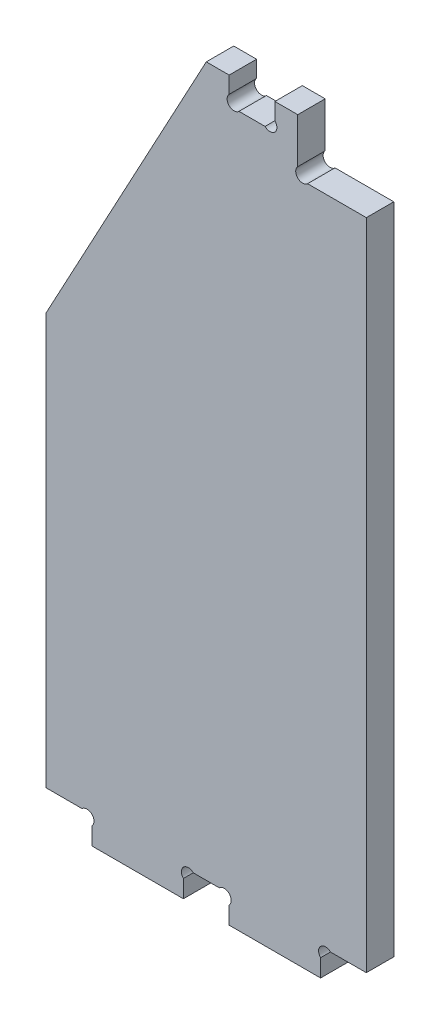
ISO-10303-21;
HEADER;
FILE_DESCRIPTION(('STEP AP214'),'2;1');
FILE_NAME('part.step','',(''),(''),'','','');
FILE_SCHEMA(('AUTOMOTIVE_DESIGN { 1 0 10303 214 1 1 1 1 }'));
ENDSEC;
DATA;
#1=APPLICATION_CONTEXT('core data for automotive mechanical design processes');
#2=APPLICATION_PROTOCOL_DEFINITION('international standard','automotive_design',2000,#1);
#3=PRODUCT_CONTEXT('',#1,'mechanical');
#4=PRODUCT('Part','Part','',(#3));
#5=PRODUCT_RELATED_PRODUCT_CATEGORY('part','',(#4));
#6=PRODUCT_DEFINITION_FORMATION('','',#4);
#7=PRODUCT_DEFINITION_CONTEXT('part definition',#1,'design');
#8=PRODUCT_DEFINITION('design','',#6,#7);
#9=PRODUCT_DEFINITION_SHAPE('','',#8);
#10=(LENGTH_UNIT() NAMED_UNIT(*) SI_UNIT(.MILLI.,.METRE.));
#11=(NAMED_UNIT(*) PLANE_ANGLE_UNIT() SI_UNIT($,.RADIAN.));
#12=(NAMED_UNIT(*) SI_UNIT($,.STERADIAN.) SOLID_ANGLE_UNIT());
#13=UNCERTAINTY_MEASURE_WITH_UNIT(LENGTH_MEASURE(1.E-05),#10,'distance_accuracy_value','');
#14=(GEOMETRIC_REPRESENTATION_CONTEXT(3) GLOBAL_UNCERTAINTY_ASSIGNED_CONTEXT((#13)) GLOBAL_UNIT_ASSIGNED_CONTEXT((#10,
#11,#12)) REPRESENTATION_CONTEXT('',''));
#15=CARTESIAN_POINT('',(0.,0.,0.));
#16=DIRECTION('',(0.,0.,1.));
#17=DIRECTION('',(1.,0.,0.));
#18=AXIS2_PLACEMENT_3D('',#15,#16,#17);
#19=CARTESIAN_POINT('',(0.,90.,6.));
#20=DIRECTION('',(1.,0.,0.));
#21=DIRECTION('',(0.,0.,-1.));
#22=AXIS2_PLACEMENT_3D('',#19,#20,#21);
#23=PLANE('',#22);
#24=DIRECTION('',(0.,-1.,0.));
#25=VECTOR('',#24,1.);
#26=CARTESIAN_POINT('',(0.,90.,0.));
#27=LINE('',#26,#25);
#28=CARTESIAN_POINT('',(0.,90.,0.));
#29=VERTEX_POINT('',#28);
#30=CARTESIAN_POINT('',(0.,0.,0.));
#31=VERTEX_POINT('',#30);
#32=EDGE_CURVE('E202',#29,#31,#27,.T.);
#33=ORIENTED_EDGE('',*,*,#32,.T.);
#34=DIRECTION('',(0.,0.,-1.));
#35=VECTOR('',#34,1.);
#36=CARTESIAN_POINT('',(0.,0.,6.));
#37=LINE('',#36,#35);
#38=CARTESIAN_POINT('',(0.,0.,6.));
#39=VERTEX_POINT('',#38);
#40=EDGE_CURVE('E11',#39,#31,#37,.T.);
#41=ORIENTED_EDGE('',*,*,#40,.F.);
#42=DIRECTION('',(0.,-1.,0.));
#43=VECTOR('',#42,1.);
#44=CARTESIAN_POINT('',(0.,90.,6.));
#45=LINE('',#44,#43);
#46=CARTESIAN_POINT('',(0.,90.,6.));
#47=VERTEX_POINT('',#46);
#48=EDGE_CURVE('E265',#47,#39,#45,.T.);
#49=ORIENTED_EDGE('',*,*,#48,.F.);
#50=DIRECTION('',(0.,0.,-1.));
#51=VECTOR('',#50,1.);
#52=CARTESIAN_POINT('',(0.,90.,6.));
#53=LINE('',#52,#51);
#54=EDGE_CURVE('E215',#47,#29,#53,.T.);
#55=ORIENTED_EDGE('',*,*,#54,.T.);
#56=EDGE_LOOP('',(#33,#41,#49,#55));
#57=FACE_BOUND('',#56,.T.);
#58=ADVANCED_FACE('F26',(#57),#23,.F.);
#59=CARTESIAN_POINT('',(0.,0.,6.));
#60=DIRECTION('',(0.,1.,0.));
#61=DIRECTION('',(0.,0.,1.));
#62=AXIS2_PLACEMENT_3D('',#59,#60,#61);
#63=PLANE('',#62);
#64=DIRECTION('',(1.,0.,0.));
#65=VECTOR('',#64,1.);
#66=CARTESIAN_POINT('',(0.,0.,0.));
#67=LINE('',#66,#65);
#68=CARTESIAN_POINT('',(7.85039538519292,0.,0.));
#69=VERTEX_POINT('',#68);
#70=EDGE_CURVE('E198',#31,#69,#67,.T.);
#71=ORIENTED_EDGE('',*,*,#70,.T.);
#72=DIRECTION('',(0.,0.,-1.));
#73=VECTOR('',#72,1.);
#74=CARTESIAN_POINT('',(7.85039538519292,0.,6.));
#75=LINE('',#74,#73);
#76=CARTESIAN_POINT('',(7.85039538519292,0.,6.));
#77=VERTEX_POINT('',#76);
#78=EDGE_CURVE('E33',#77,#69,#75,.T.);
#79=ORIENTED_EDGE('',*,*,#78,.F.);
#80=DIRECTION('',(1.,0.,0.));
#81=VECTOR('',#80,1.);
#82=CARTESIAN_POINT('',(0.,0.,6.));
#83=LINE('',#82,#81);
#84=EDGE_CURVE('E211',#39,#77,#83,.T.);
#85=ORIENTED_EDGE('',*,*,#84,.F.);
#86=ORIENTED_EDGE('',*,*,#40,.T.);
#87=EDGE_LOOP('',(#71,#79,#85,#86));
#88=FACE_BOUND('',#87,.T.);
#89=ADVANCED_FACE('F210',(#88),#63,.F.);
#90=CARTESIAN_POINT('',(8.92519769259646,-1.07480230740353,6.));
#91=DIRECTION('',(0.,0.,-1.));
#92=DIRECTION('',(-1.,0.,0.));
#93=AXIS2_PLACEMENT_3D('',#90,#91,#92);
#94=CYLINDRICAL_SURFACE('',#93,1.51999999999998);
#95=CARTESIAN_POINT('',(8.92519769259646,-1.07480230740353,0.));
#96=DIRECTION('',(0.,0.,-1.));
#97=DIRECTION('',(1.,0.,0.));
#98=AXIS2_PLACEMENT_3D('',#95,#96,#97);
#99=CIRCLE('',#98,1.51999999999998);
#100=CARTESIAN_POINT('',(10.,-2.14960461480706,0.));
#101=VERTEX_POINT('',#100);
#102=EDGE_CURVE('E204',#69,#101,#99,.T.);
#103=ORIENTED_EDGE('',*,*,#102,.T.);
#104=DIRECTION('',(0.,0.,-1.));
#105=VECTOR('',#104,1.);
#106=CARTESIAN_POINT('',(10.,-2.14960461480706,6.));
#107=LINE('',#106,#105);
#108=CARTESIAN_POINT('',(10.,-2.14960461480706,6.));
#109=VERTEX_POINT('',#108);
#110=EDGE_CURVE('E381',#109,#101,#107,.T.);
#111=ORIENTED_EDGE('',*,*,#110,.F.);
#112=CARTESIAN_POINT('',(8.92519769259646,-1.07480230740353,6.));
#113=DIRECTION('',(0.,0.,-1.));
#114=DIRECTION('',(1.,0.,0.));
#115=AXIS2_PLACEMENT_3D('',#112,#113,#114);
#116=CIRCLE('',#115,1.51999999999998);
#117=EDGE_CURVE('E268',#77,#109,#116,.T.);
#118=ORIENTED_EDGE('',*,*,#117,.F.);
#119=ORIENTED_EDGE('',*,*,#78,.T.);
#120=EDGE_LOOP('',(#103,#111,#118,#119));
#121=FACE_BOUND('',#120,.T.);
#122=ADVANCED_FACE('F385',(#121),#94,.F.);
#123=CARTESIAN_POINT('',(10.,-2.14960461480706,6.));
#124=DIRECTION('',(1.,0.,0.));
#125=DIRECTION('',(0.,1.,0.));
#126=AXIS2_PLACEMENT_3D('',#123,#124,#125);
#127=PLANE('',#126);
#128=DIRECTION('',(0.,-1.,0.));
#129=VECTOR('',#128,1.);
#130=CARTESIAN_POINT('',(10.,-2.14960461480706,0.));
#131=LINE('',#130,#129);
#132=CARTESIAN_POINT('',(10.,-6.,0.));
#133=VERTEX_POINT('',#132);
#134=EDGE_CURVE('E219',#101,#133,#131,.T.);
#135=ORIENTED_EDGE('',*,*,#134,.T.);
#136=DIRECTION('',(0.,0.,-1.));
#137=VECTOR('',#136,1.);
#138=CARTESIAN_POINT('',(10.,-6.,6.));
#139=LINE('',#138,#137);
#140=CARTESIAN_POINT('',(10.,-6.,6.));
#141=VERTEX_POINT('',#140);
#142=EDGE_CURVE('E378',#141,#133,#139,.T.);
#143=ORIENTED_EDGE('',*,*,#142,.F.);
#144=DIRECTION('',(0.,-1.,0.));
#145=VECTOR('',#144,1.);
#146=CARTESIAN_POINT('',(10.,-2.14960461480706,6.));
#147=LINE('',#146,#145);
#148=EDGE_CURVE('E270',#109,#141,#147,.T.);
#149=ORIENTED_EDGE('',*,*,#148,.F.);
#150=ORIENTED_EDGE('',*,*,#110,.T.);
#151=EDGE_LOOP('',(#135,#143,#149,#150));
#152=FACE_BOUND('',#151,.T.);
#153=ADVANCED_FACE('F393',(#152),#127,.F.);
#154=CARTESIAN_POINT('',(10.,-6.,6.));
#155=DIRECTION('',(0.,1.,0.));
#156=DIRECTION('',(-1.,0.,0.));
#157=AXIS2_PLACEMENT_3D('',#154,#155,#156);
#158=PLANE('',#157);
#159=DIRECTION('',(1.,0.,0.));
#160=VECTOR('',#159,1.);
#161=CARTESIAN_POINT('',(10.,-6.,0.));
#162=LINE('',#161,#160);
#163=CARTESIAN_POINT('',(30.,-6.,0.));
#164=VERTEX_POINT('',#163);
#165=EDGE_CURVE('E221',#133,#164,#162,.T.);
#166=ORIENTED_EDGE('',*,*,#165,.T.);
#167=DIRECTION('',(0.,0.,-1.));
#168=VECTOR('',#167,1.);
#169=CARTESIAN_POINT('',(30.,-6.,6.));
#170=LINE('',#169,#168);
#171=CARTESIAN_POINT('',(30.,-6.,6.));
#172=VERTEX_POINT('',#171);
#173=EDGE_CURVE('E375',#172,#164,#170,.T.);
#174=ORIENTED_EDGE('',*,*,#173,.F.);
#175=DIRECTION('',(1.,0.,0.));
#176=VECTOR('',#175,1.);
#177=CARTESIAN_POINT('',(10.,-6.,6.));
#178=LINE('',#177,#176);
#179=EDGE_CURVE('E272',#141,#172,#178,.T.);
#180=ORIENTED_EDGE('',*,*,#179,.F.);
#181=ORIENTED_EDGE('',*,*,#142,.T.);
#182=EDGE_LOOP('',(#166,#174,#180,#181));
#183=FACE_BOUND('',#182,.T.);
#184=ADVANCED_FACE('F396',(#183),#158,.F.);
#185=CARTESIAN_POINT('',(30.,-6.,6.));
#186=DIRECTION('',(-1.,0.,0.));
#187=DIRECTION('',(0.,-1.,0.));
#188=AXIS2_PLACEMENT_3D('',#185,#186,#187);
#189=PLANE('',#188);
#190=DIRECTION('',(0.,1.,0.));
#191=VECTOR('',#190,1.);
#192=CARTESIAN_POINT('',(30.,-6.,0.));
#193=LINE('',#192,#191);
#194=CARTESIAN_POINT('',(30.,-2.1496046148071,0.));
#195=VERTEX_POINT('',#194);
#196=EDGE_CURVE('E223',#164,#195,#193,.T.);
#197=ORIENTED_EDGE('',*,*,#196,.T.);
#198=DIRECTION('',(0.,0.,-1.));
#199=VECTOR('',#198,1.);
#200=CARTESIAN_POINT('',(30.,-2.1496046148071,6.));
#201=LINE('',#200,#199);
#202=CARTESIAN_POINT('',(30.,-2.1496046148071,6.));
#203=VERTEX_POINT('',#202);
#204=EDGE_CURVE('E372',#203,#195,#201,.T.);
#205=ORIENTED_EDGE('',*,*,#204,.F.);
#206=DIRECTION('',(0.,1.,0.));
#207=VECTOR('',#206,1.);
#208=CARTESIAN_POINT('',(30.,-6.,6.));
#209=LINE('',#208,#207);
#210=EDGE_CURVE('E274',#172,#203,#209,.T.);
#211=ORIENTED_EDGE('',*,*,#210,.F.);
#212=ORIENTED_EDGE('',*,*,#173,.T.);
#213=EDGE_LOOP('',(#197,#205,#211,#212));
#214=FACE_BOUND('',#213,.T.);
#215=ADVANCED_FACE('F401',(#214),#189,.F.);
#216=CARTESIAN_POINT('',(31.0748023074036,-1.07480230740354,6.));
#217=DIRECTION('',(0.,0.,-1.));
#218=DIRECTION('',(-1.,0.,0.));
#219=AXIS2_PLACEMENT_3D('',#216,#217,#218);
#220=CYLINDRICAL_SURFACE('',#219,1.52);
#221=CARTESIAN_POINT('',(31.0748023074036,-1.07480230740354,0.));
#222=DIRECTION('',(0.,0.,-1.));
#223=DIRECTION('',(-1.,0.,0.));
#224=AXIS2_PLACEMENT_3D('',#221,#222,#223);
#225=CIRCLE('',#224,1.52);
#226=CARTESIAN_POINT('',(32.1496046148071,0.,0.));
#227=VERTEX_POINT('',#226);
#228=EDGE_CURVE('E225',#195,#227,#225,.T.);
#229=ORIENTED_EDGE('',*,*,#228,.T.);
#230=DIRECTION('',(0.,0.,-1.));
#231=VECTOR('',#230,1.);
#232=CARTESIAN_POINT('',(32.1496046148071,0.,6.));
#233=LINE('',#232,#231);
#234=CARTESIAN_POINT('',(32.1496046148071,0.,6.));
#235=VERTEX_POINT('',#234);
#236=EDGE_CURVE('E369',#235,#227,#233,.T.);
#237=ORIENTED_EDGE('',*,*,#236,.F.);
#238=CARTESIAN_POINT('',(31.0748023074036,-1.07480230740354,6.));
#239=DIRECTION('',(0.,0.,-1.));
#240=DIRECTION('',(-1.,0.,0.));
#241=AXIS2_PLACEMENT_3D('',#238,#239,#240);
#242=CIRCLE('',#241,1.52);
#243=EDGE_CURVE('E276',#203,#235,#242,.T.);
#244=ORIENTED_EDGE('',*,*,#243,.F.);
#245=ORIENTED_EDGE('',*,*,#204,.T.);
#246=EDGE_LOOP('',(#229,#237,#244,#245));
#247=FACE_BOUND('',#246,.T.);
#248=ADVANCED_FACE('F407',(#247),#220,.F.);
#249=CARTESIAN_POINT('',(32.1496046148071,0.,6.));
#250=DIRECTION('',(0.,1.,0.));
#251=DIRECTION('',(-1.,0.,0.));
#252=AXIS2_PLACEMENT_3D('',#249,#250,#251);
#253=PLANE('',#252);
#254=DIRECTION('',(1.,0.,0.));
#255=VECTOR('',#254,1.);
#256=CARTESIAN_POINT('',(32.1496046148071,0.,0.));
#257=LINE('',#256,#255);
#258=CARTESIAN_POINT('',(37.8503953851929,0.,0.));
#259=VERTEX_POINT('',#258);
#260=EDGE_CURVE('E227',#227,#259,#257,.T.);
#261=ORIENTED_EDGE('',*,*,#260,.T.);
#262=DIRECTION('',(0.,0.,-1.));
#263=VECTOR('',#262,1.);
#264=CARTESIAN_POINT('',(37.8503953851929,0.,6.));
#265=LINE('',#264,#263);
#266=CARTESIAN_POINT('',(37.8503953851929,0.,6.));
#267=VERTEX_POINT('',#266);
#268=EDGE_CURVE('E366',#267,#259,#265,.T.);
#269=ORIENTED_EDGE('',*,*,#268,.F.);
#270=DIRECTION('',(1.,0.,0.));
#271=VECTOR('',#270,1.);
#272=CARTESIAN_POINT('',(32.1496046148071,0.,6.));
#273=LINE('',#272,#271);
#274=EDGE_CURVE('E278',#235,#267,#273,.T.);
#275=ORIENTED_EDGE('',*,*,#274,.F.);
#276=ORIENTED_EDGE('',*,*,#236,.T.);
#277=EDGE_LOOP('',(#261,#269,#275,#276));
#278=FACE_BOUND('',#277,.T.);
#279=ADVANCED_FACE('F411',(#278),#253,.F.);
#280=CARTESIAN_POINT('',(38.9251976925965,-1.07480230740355,6.));
#281=DIRECTION('',(0.,0.,-1.));
#282=DIRECTION('',(-1.,0.,0.));
#283=AXIS2_PLACEMENT_3D('',#280,#281,#282);
#284=CYLINDRICAL_SURFACE('',#283,1.52);
#285=CARTESIAN_POINT('',(38.9251976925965,-1.07480230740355,0.));
#286=DIRECTION('',(0.,0.,-1.));
#287=DIRECTION('',(1.,0.,0.));
#288=AXIS2_PLACEMENT_3D('',#285,#286,#287);
#289=CIRCLE('',#288,1.52);
#290=CARTESIAN_POINT('',(40.,-2.1496046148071,0.));
#291=VERTEX_POINT('',#290);
#292=EDGE_CURVE('E229',#259,#291,#289,.T.);
#293=ORIENTED_EDGE('',*,*,#292,.T.);
#294=DIRECTION('',(0.,0.,-1.));
#295=VECTOR('',#294,1.);
#296=CARTESIAN_POINT('',(40.,-2.1496046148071,6.));
#297=LINE('',#296,#295);
#298=CARTESIAN_POINT('',(40.,-2.1496046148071,6.));
#299=VERTEX_POINT('',#298);
#300=EDGE_CURVE('E363',#299,#291,#297,.T.);
#301=ORIENTED_EDGE('',*,*,#300,.F.);
#302=CARTESIAN_POINT('',(38.9251976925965,-1.07480230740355,6.));
#303=DIRECTION('',(0.,0.,-1.));
#304=DIRECTION('',(1.,0.,0.));
#305=AXIS2_PLACEMENT_3D('',#302,#303,#304);
#306=CIRCLE('',#305,1.52);
#307=EDGE_CURVE('E280',#267,#299,#306,.T.);
#308=ORIENTED_EDGE('',*,*,#307,.F.);
#309=ORIENTED_EDGE('',*,*,#268,.T.);
#310=EDGE_LOOP('',(#293,#301,#308,#309));
#311=FACE_BOUND('',#310,.T.);
#312=ADVANCED_FACE('F416',(#311),#284,.F.);
#313=CARTESIAN_POINT('',(40.,-6.,6.));
#314=DIRECTION('',(1.,0.,0.));
#315=DIRECTION('',(0.,0.,-1.));
#316=AXIS2_PLACEMENT_3D('',#313,#314,#315);
#317=PLANE('',#316);
#318=DIRECTION('',(0.,-1.,0.));
#319=VECTOR('',#318,1.);
#320=CARTESIAN_POINT('',(40.,-6.,0.));
#321=LINE('',#320,#319);
#322=CARTESIAN_POINT('',(40.,-6.,0.));
#323=VERTEX_POINT('',#322);
#324=EDGE_CURVE('E231',#291,#323,#321,.T.);
#325=ORIENTED_EDGE('',*,*,#324,.T.);
#326=DIRECTION('',(0.,0.,-1.));
#327=VECTOR('',#326,1.);
#328=CARTESIAN_POINT('',(40.,-6.,6.));
#329=LINE('',#328,#327);
#330=CARTESIAN_POINT('',(40.,-6.,6.));
#331=VERTEX_POINT('',#330);
#332=EDGE_CURVE('E360',#331,#323,#329,.T.);
#333=ORIENTED_EDGE('',*,*,#332,.F.);
#334=DIRECTION('',(0.,-1.,0.));
#335=VECTOR('',#334,1.);
#336=CARTESIAN_POINT('',(40.,-6.,6.));
#337=LINE('',#336,#335);
#338=EDGE_CURVE('E282',#299,#331,#337,.T.);
#339=ORIENTED_EDGE('',*,*,#338,.F.);
#340=ORIENTED_EDGE('',*,*,#300,.T.);
#341=EDGE_LOOP('',(#325,#333,#339,#340));
#342=FACE_BOUND('',#341,.T.);
#343=ADVANCED_FACE('F422',(#342),#317,.F.);
#344=CARTESIAN_POINT('',(60.,-6.,6.));
#345=DIRECTION('',(0.,1.,0.));
#346=DIRECTION('',(0.,0.,1.));
#347=AXIS2_PLACEMENT_3D('',#344,#345,#346);
#348=PLANE('',#347);
#349=DIRECTION('',(1.,0.,0.));
#350=VECTOR('',#349,1.);
#351=CARTESIAN_POINT('',(60.,-6.,0.));
#352=LINE('',#351,#350);
#353=CARTESIAN_POINT('',(60.,-6.,0.));
#354=VERTEX_POINT('',#353);
#355=EDGE_CURVE('E233',#323,#354,#352,.T.);
#356=ORIENTED_EDGE('',*,*,#355,.T.);
#357=DIRECTION('',(0.,0.,-1.));
#358=VECTOR('',#357,1.);
#359=CARTESIAN_POINT('',(60.,-6.,6.));
#360=LINE('',#359,#358);
#361=CARTESIAN_POINT('',(60.,-6.,6.));
#362=VERTEX_POINT('',#361);
#363=EDGE_CURVE('E357',#362,#354,#360,.T.);
#364=ORIENTED_EDGE('',*,*,#363,.F.);
#365=DIRECTION('',(1.,0.,0.));
#366=VECTOR('',#365,1.);
#367=CARTESIAN_POINT('',(60.,-6.,6.));
#368=LINE('',#367,#366);
#369=EDGE_CURVE('E284',#331,#362,#368,.T.);
#370=ORIENTED_EDGE('',*,*,#369,.F.);
#371=ORIENTED_EDGE('',*,*,#332,.T.);
#372=EDGE_LOOP('',(#356,#364,#370,#371));
#373=FACE_BOUND('',#372,.T.);
#374=ADVANCED_FACE('F426',(#373),#348,.F.);
#375=CARTESIAN_POINT('',(60.,-2.1496046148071,6.));
#376=DIRECTION('',(-1.,0.,0.));
#377=DIRECTION('',(0.,0.,1.));
#378=AXIS2_PLACEMENT_3D('',#375,#376,#377);
#379=PLANE('',#378);
#380=DIRECTION('',(0.,1.,0.));
#381=VECTOR('',#380,1.);
#382=CARTESIAN_POINT('',(60.,-2.1496046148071,0.));
#383=LINE('',#382,#381);
#384=CARTESIAN_POINT('',(60.,-2.1496046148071,0.));
#385=VERTEX_POINT('',#384);
#386=EDGE_CURVE('E235',#354,#385,#383,.T.);
#387=ORIENTED_EDGE('',*,*,#386,.T.);
#388=DIRECTION('',(0.,0.,-1.));
#389=VECTOR('',#388,1.);
#390=CARTESIAN_POINT('',(60.,-2.1496046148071,6.));
#391=LINE('',#390,#389);
#392=CARTESIAN_POINT('',(60.,-2.1496046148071,6.));
#393=VERTEX_POINT('',#392);
#394=EDGE_CURVE('E354',#393,#385,#391,.T.);
#395=ORIENTED_EDGE('',*,*,#394,.F.);
#396=DIRECTION('',(0.,1.,0.));
#397=VECTOR('',#396,1.);
#398=CARTESIAN_POINT('',(60.,-2.1496046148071,6.));
#399=LINE('',#398,#397);
#400=EDGE_CURVE('E286',#362,#393,#399,.T.);
#401=ORIENTED_EDGE('',*,*,#400,.F.);
#402=ORIENTED_EDGE('',*,*,#363,.T.);
#403=EDGE_LOOP('',(#387,#395,#401,#402));
#404=FACE_BOUND('',#403,.T.);
#405=ADVANCED_FACE('F431',(#404),#379,.F.);
#406=CARTESIAN_POINT('',(61.0748023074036,-1.07480230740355,6.));
#407=DIRECTION('',(0.,0.,-1.));
#408=DIRECTION('',(-1.,0.,0.));
#409=AXIS2_PLACEMENT_3D('',#406,#407,#408);
#410=CYLINDRICAL_SURFACE('',#409,1.52);
#411=CARTESIAN_POINT('',(61.0748023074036,-1.07480230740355,0.));
#412=DIRECTION('',(0.,0.,-1.));
#413=DIRECTION('',(-1.,0.,0.));
#414=AXIS2_PLACEMENT_3D('',#411,#412,#413);
#415=CIRCLE('',#414,1.52);
#416=CARTESIAN_POINT('',(62.1496046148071,0.,0.));
#417=VERTEX_POINT('',#416);
#418=EDGE_CURVE('E237',#385,#417,#415,.T.);
#419=ORIENTED_EDGE('',*,*,#418,.T.);
#420=DIRECTION('',(0.,0.,-1.));
#421=VECTOR('',#420,1.);
#422=CARTESIAN_POINT('',(62.1496046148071,0.,6.));
#423=LINE('',#422,#421);
#424=CARTESIAN_POINT('',(62.1496046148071,0.,6.));
#425=VERTEX_POINT('',#424);
#426=EDGE_CURVE('E351',#425,#417,#423,.T.);
#427=ORIENTED_EDGE('',*,*,#426,.F.);
#428=CARTESIAN_POINT('',(61.0748023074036,-1.07480230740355,6.));
#429=DIRECTION('',(0.,0.,-1.));
#430=DIRECTION('',(-1.,0.,0.));
#431=AXIS2_PLACEMENT_3D('',#428,#429,#430);
#432=CIRCLE('',#431,1.52);
#433=EDGE_CURVE('E288',#393,#425,#432,.T.);
#434=ORIENTED_EDGE('',*,*,#433,.F.);
#435=ORIENTED_EDGE('',*,*,#394,.T.);
#436=EDGE_LOOP('',(#419,#427,#434,#435));
#437=FACE_BOUND('',#436,.T.);
#438=ADVANCED_FACE('F437',(#437),#410,.F.);
#439=CARTESIAN_POINT('',(70.,0.,6.));
#440=DIRECTION('',(0.,1.,0.));
#441=DIRECTION('',(0.,0.,1.));
#442=AXIS2_PLACEMENT_3D('',#439,#440,#441);
#443=PLANE('',#442);
#444=DIRECTION('',(1.,0.,0.));
#445=VECTOR('',#444,1.);
#446=CARTESIAN_POINT('',(70.,0.,0.));
#447=LINE('',#446,#445);
#448=CARTESIAN_POINT('',(70.,0.,0.));
#449=VERTEX_POINT('',#448);
#450=EDGE_CURVE('E239',#417,#449,#447,.T.);
#451=ORIENTED_EDGE('',*,*,#450,.T.);
#452=DIRECTION('',(0.,0.,-1.));
#453=VECTOR('',#452,1.);
#454=CARTESIAN_POINT('',(70.,0.,6.));
#455=LINE('',#454,#453);
#456=CARTESIAN_POINT('',(70.,0.,6.));
#457=VERTEX_POINT('',#456);
#458=EDGE_CURVE('E348',#457,#449,#455,.T.);
#459=ORIENTED_EDGE('',*,*,#458,.F.);
#460=DIRECTION('',(1.,0.,0.));
#461=VECTOR('',#460,1.);
#462=CARTESIAN_POINT('',(70.,0.,6.));
#463=LINE('',#462,#461);
#464=EDGE_CURVE('E290',#425,#457,#463,.T.);
#465=ORIENTED_EDGE('',*,*,#464,.F.);
#466=ORIENTED_EDGE('',*,*,#426,.T.);
#467=EDGE_LOOP('',(#451,#459,#465,#466));
#468=FACE_BOUND('',#467,.T.);
#469=ADVANCED_FACE('F441',(#468),#443,.F.);
#470=CARTESIAN_POINT('',(70.,143.,6.));
#471=DIRECTION('',(-1.,0.,0.));
#472=DIRECTION('',(0.,-1.,0.));
#473=AXIS2_PLACEMENT_3D('',#470,#471,#472);
#474=PLANE('',#473);
#475=DIRECTION('',(0.,1.,0.));
#476=VECTOR('',#475,1.);
#477=CARTESIAN_POINT('',(70.,143.,0.));
#478=LINE('',#477,#476);
#479=CARTESIAN_POINT('',(70.,143.,0.));
#480=VERTEX_POINT('',#479);
#481=EDGE_CURVE('E241',#449,#480,#478,.T.);
#482=ORIENTED_EDGE('',*,*,#481,.T.);
#483=DIRECTION('',(0.,0.,-1.));
#484=VECTOR('',#483,1.);
#485=CARTESIAN_POINT('',(70.,143.,6.));
#486=LINE('',#485,#484);
#487=CARTESIAN_POINT('',(70.,143.,6.));
#488=VERTEX_POINT('',#487);
#489=EDGE_CURVE('E345',#488,#480,#486,.T.);
#490=ORIENTED_EDGE('',*,*,#489,.F.);
#491=DIRECTION('',(0.,1.,0.));
#492=VECTOR('',#491,1.);
#493=CARTESIAN_POINT('',(70.,143.,6.));
#494=LINE('',#493,#492);
#495=EDGE_CURVE('E292',#457,#488,#494,.T.);
#496=ORIENTED_EDGE('',*,*,#495,.F.);
#497=ORIENTED_EDGE('',*,*,#458,.T.);
#498=EDGE_LOOP('',(#482,#490,#496,#497));
#499=FACE_BOUND('',#498,.T.);
#500=ADVANCED_FACE('F446',(#499),#474,.F.);
#501=CARTESIAN_POINT('',(57.149604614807,143.,6.));
#502=DIRECTION('',(0.,-1.,0.));
#503=DIRECTION('',(0.,0.,-1.));
#504=AXIS2_PLACEMENT_3D('',#501,#502,#503);
#505=PLANE('',#504);
#506=DIRECTION('',(-1.,0.,0.));
#507=VECTOR('',#506,1.);
#508=CARTESIAN_POINT('',(57.149604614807,143.,0.));
#509=LINE('',#508,#507);
#510=CARTESIAN_POINT('',(57.149604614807,143.,0.));
#511=VERTEX_POINT('',#510);
#512=EDGE_CURVE('E243',#480,#511,#509,.T.);
#513=ORIENTED_EDGE('',*,*,#512,.T.);
#514=DIRECTION('',(0.,0.,-1.));
#515=VECTOR('',#514,1.);
#516=CARTESIAN_POINT('',(57.149604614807,143.,6.));
#517=LINE('',#516,#515);
#518=CARTESIAN_POINT('',(57.149604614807,143.,6.));
#519=VERTEX_POINT('',#518);
#520=EDGE_CURVE('E342',#519,#511,#517,.T.);
#521=ORIENTED_EDGE('',*,*,#520,.F.);
#522=DIRECTION('',(-1.,0.,0.));
#523=VECTOR('',#522,1.);
#524=CARTESIAN_POINT('',(57.149604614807,143.,6.));
#525=LINE('',#524,#523);
#526=EDGE_CURVE('E294',#488,#519,#525,.T.);
#527=ORIENTED_EDGE('',*,*,#526,.F.);
#528=ORIENTED_EDGE('',*,*,#489,.T.);
#529=EDGE_LOOP('',(#513,#521,#527,#528));
#530=FACE_BOUND('',#529,.T.);
#531=ADVANCED_FACE('F452',(#530),#505,.F.);
#532=CARTESIAN_POINT('',(56.0748023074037,144.074802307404,6.));
#533=DIRECTION('',(0.,0.,-1.));
#534=DIRECTION('',(-1.,0.,0.));
#535=AXIS2_PLACEMENT_3D('',#532,#533,#534);
#536=CYLINDRICAL_SURFACE('',#535,1.51999999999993);
#537=CARTESIAN_POINT('',(56.0748023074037,144.074802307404,0.));
#538=DIRECTION('',(0.,0.,-1.));
#539=DIRECTION('',(1.,0.,0.));
#540=AXIS2_PLACEMENT_3D('',#537,#538,#539);
#541=CIRCLE('',#540,1.51999999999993);
#542=CARTESIAN_POINT('',(55.,145.149604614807,0.));
#543=VERTEX_POINT('',#542);
#544=EDGE_CURVE('E245',#511,#543,#541,.T.);
#545=ORIENTED_EDGE('',*,*,#544,.T.);
#546=DIRECTION('',(0.,0.,-1.));
#547=VECTOR('',#546,1.);
#548=CARTESIAN_POINT('',(55.,145.149604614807,6.));
#549=LINE('',#548,#547);
#550=CARTESIAN_POINT('',(55.,145.149604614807,6.));
#551=VERTEX_POINT('',#550);
#552=EDGE_CURVE('E339',#551,#543,#549,.T.);
#553=ORIENTED_EDGE('',*,*,#552,.F.);
#554=CARTESIAN_POINT('',(56.0748023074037,144.074802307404,6.));
#555=DIRECTION('',(0.,0.,-1.));
#556=DIRECTION('',(1.,0.,0.));
#557=AXIS2_PLACEMENT_3D('',#554,#555,#556);
#558=CIRCLE('',#557,1.51999999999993);
#559=EDGE_CURVE('E296',#519,#551,#558,.T.);
#560=ORIENTED_EDGE('',*,*,#559,.F.);
#561=ORIENTED_EDGE('',*,*,#520,.T.);
#562=EDGE_LOOP('',(#545,#553,#560,#561));
#563=FACE_BOUND('',#562,.T.);
#564=ADVANCED_FACE('F456',(#563),#536,.F.);
#565=CARTESIAN_POINT('',(55.,155.,6.));
#566=DIRECTION('',(-1.,0.,0.));
#567=DIRECTION('',(0.,-1.,0.));
#568=AXIS2_PLACEMENT_3D('',#565,#566,#567);
#569=PLANE('',#568);
#570=DIRECTION('',(0.,1.,0.));
#571=VECTOR('',#570,1.);
#572=CARTESIAN_POINT('',(55.,155.,0.));
#573=LINE('',#572,#571);
#574=CARTESIAN_POINT('',(55.,155.,0.));
#575=VERTEX_POINT('',#574);
#576=EDGE_CURVE('E247',#543,#575,#573,.T.);
#577=ORIENTED_EDGE('',*,*,#576,.T.);
#578=DIRECTION('',(0.,0.,-1.));
#579=VECTOR('',#578,1.);
#580=CARTESIAN_POINT('',(55.,155.,6.));
#581=LINE('',#580,#579);
#582=CARTESIAN_POINT('',(55.,155.,6.));
#583=VERTEX_POINT('',#582);
#584=EDGE_CURVE('E336',#583,#575,#581,.T.);
#585=ORIENTED_EDGE('',*,*,#584,.F.);
#586=DIRECTION('',(0.,1.,0.));
#587=VECTOR('',#586,1.);
#588=CARTESIAN_POINT('',(55.,155.,6.));
#589=LINE('',#588,#587);
#590=EDGE_CURVE('E298',#551,#583,#589,.T.);
#591=ORIENTED_EDGE('',*,*,#590,.F.);
#592=ORIENTED_EDGE('',*,*,#552,.T.);
#593=EDGE_LOOP('',(#577,#585,#591,#592));
#594=FACE_BOUND('',#593,.T.);
#595=ADVANCED_FACE('F461',(#594),#569,.F.);
#596=CARTESIAN_POINT('',(50.,155.,6.));
#597=DIRECTION('',(0.,-1.,0.));
#598=DIRECTION('',(0.,0.,-1.));
#599=AXIS2_PLACEMENT_3D('',#596,#597,#598);
#600=PLANE('',#599);
#601=DIRECTION('',(-1.,0.,0.));
#602=VECTOR('',#601,1.);
#603=CARTESIAN_POINT('',(50.,155.,0.));
#604=LINE('',#603,#602);
#605=CARTESIAN_POINT('',(50.,155.,0.));
#606=VERTEX_POINT('',#605);
#607=EDGE_CURVE('E249',#575,#606,#604,.T.);
#608=ORIENTED_EDGE('',*,*,#607,.T.);
#609=DIRECTION('',(0.,0.,-1.));
#610=VECTOR('',#609,1.);
#611=CARTESIAN_POINT('',(50.,155.,6.));
#612=LINE('',#611,#610);
#613=CARTESIAN_POINT('',(50.,155.,6.));
#614=VERTEX_POINT('',#613);
#615=EDGE_CURVE('E333',#614,#606,#612,.T.);
#616=ORIENTED_EDGE('',*,*,#615,.F.);
#617=DIRECTION('',(-1.,0.,0.));
#618=VECTOR('',#617,1.);
#619=CARTESIAN_POINT('',(50.,155.,6.));
#620=LINE('',#619,#618);
#621=EDGE_CURVE('E300',#583,#614,#620,.T.);
#622=ORIENTED_EDGE('',*,*,#621,.F.);
#623=ORIENTED_EDGE('',*,*,#584,.T.);
#624=EDGE_LOOP('',(#608,#616,#622,#623));
#625=FACE_BOUND('',#624,.T.);
#626=ADVANCED_FACE('F467',(#625),#600,.F.);
#627=CARTESIAN_POINT('',(50.,151.349604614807,6.));
#628=DIRECTION('',(1.,0.,0.));
#629=DIRECTION('',(0.,0.,-1.));
#630=AXIS2_PLACEMENT_3D('',#627,#628,#629);
#631=PLANE('',#630);
#632=DIRECTION('',(0.,-1.,0.));
#633=VECTOR('',#632,1.);
#634=CARTESIAN_POINT('',(50.,151.349604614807,0.));
#635=LINE('',#634,#633);
#636=CARTESIAN_POINT('',(50.,151.349604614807,0.));
#637=VERTEX_POINT('',#636);
#638=EDGE_CURVE('E251',#606,#637,#635,.T.);
#639=ORIENTED_EDGE('',*,*,#638,.T.);
#640=DIRECTION('',(0.,0.,-1.));
#641=VECTOR('',#640,1.);
#642=CARTESIAN_POINT('',(50.,151.349604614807,6.));
#643=LINE('',#642,#641);
#644=CARTESIAN_POINT('',(50.,151.349604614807,6.));
#645=VERTEX_POINT('',#644);
#646=EDGE_CURVE('E330',#645,#637,#643,.T.);
#647=ORIENTED_EDGE('',*,*,#646,.F.);
#648=DIRECTION('',(0.,-1.,0.));
#649=VECTOR('',#648,1.);
#650=CARTESIAN_POINT('',(50.,151.349604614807,6.));
#651=LINE('',#650,#649);
#652=EDGE_CURVE('E302',#614,#645,#651,.T.);
#653=ORIENTED_EDGE('',*,*,#652,.F.);
#654=ORIENTED_EDGE('',*,*,#615,.T.);
#655=EDGE_LOOP('',(#639,#647,#653,#654));
#656=FACE_BOUND('',#655,.T.);
#657=ADVANCED_FACE('F471',(#656),#631,.F.);
#658=CARTESIAN_POINT('',(48.9251976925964,150.274802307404,6.));
#659=DIRECTION('',(0.,0.,-1.));
#660=DIRECTION('',(-1.,0.,0.));
#661=AXIS2_PLACEMENT_3D('',#658,#659,#660);
#662=CYLINDRICAL_SURFACE('',#661,1.52);
#663=CARTESIAN_POINT('',(48.9251976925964,150.274802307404,0.));
#664=DIRECTION('',(0.,0.,-1.));
#665=DIRECTION('',(-1.,0.,0.));
#666=AXIS2_PLACEMENT_3D('',#663,#664,#665);
#667=CIRCLE('',#666,1.52);
#668=CARTESIAN_POINT('',(47.8503953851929,149.2,0.));
#669=VERTEX_POINT('',#668);
#670=EDGE_CURVE('E253',#637,#669,#667,.T.);
#671=ORIENTED_EDGE('',*,*,#670,.T.);
#672=DIRECTION('',(0.,0.,-1.));
#673=VECTOR('',#672,1.);
#674=CARTESIAN_POINT('',(47.8503953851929,149.2,6.));
#675=LINE('',#674,#673);
#676=CARTESIAN_POINT('',(47.8503953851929,149.2,6.));
#677=VERTEX_POINT('',#676);
#678=EDGE_CURVE('E327',#677,#669,#675,.T.);
#679=ORIENTED_EDGE('',*,*,#678,.F.);
#680=CARTESIAN_POINT('',(48.9251976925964,150.274802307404,6.));
#681=DIRECTION('',(0.,0.,-1.));
#682=DIRECTION('',(-1.,0.,0.));
#683=AXIS2_PLACEMENT_3D('',#680,#681,#682);
#684=CIRCLE('',#683,1.52);
#685=EDGE_CURVE('E304',#645,#677,#684,.T.);
#686=ORIENTED_EDGE('',*,*,#685,.F.);
#687=ORIENTED_EDGE('',*,*,#646,.T.);
#688=EDGE_LOOP('',(#671,#679,#686,#687));
#689=FACE_BOUND('',#688,.T.);
#690=ADVANCED_FACE('F476',(#689),#662,.F.);
#691=CARTESIAN_POINT('',(42.1496046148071,149.2,6.));
#692=DIRECTION('',(0.,-1.,0.));
#693=DIRECTION('',(0.,0.,-1.));
#694=AXIS2_PLACEMENT_3D('',#691,#692,#693);
#695=PLANE('',#694);
#696=DIRECTION('',(-1.,0.,0.));
#697=VECTOR('',#696,1.);
#698=CARTESIAN_POINT('',(42.1496046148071,149.2,0.));
#699=LINE('',#698,#697);
#700=CARTESIAN_POINT('',(42.1496046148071,149.2,0.));
#701=VERTEX_POINT('',#700);
#702=EDGE_CURVE('E255',#669,#701,#699,.T.);
#703=ORIENTED_EDGE('',*,*,#702,.T.);
#704=DIRECTION('',(0.,0.,-1.));
#705=VECTOR('',#704,1.);
#706=CARTESIAN_POINT('',(42.1496046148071,149.2,6.));
#707=LINE('',#706,#705);
#708=CARTESIAN_POINT('',(42.1496046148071,149.2,6.));
#709=VERTEX_POINT('',#708);
#710=EDGE_CURVE('E324',#709,#701,#707,.T.);
#711=ORIENTED_EDGE('',*,*,#710,.F.);
#712=DIRECTION('',(-1.,0.,0.));
#713=VECTOR('',#712,1.);
#714=CARTESIAN_POINT('',(42.1496046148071,149.2,6.));
#715=LINE('',#714,#713);
#716=EDGE_CURVE('E306',#677,#709,#715,.T.);
#717=ORIENTED_EDGE('',*,*,#716,.F.);
#718=ORIENTED_EDGE('',*,*,#678,.T.);
#719=EDGE_LOOP('',(#703,#711,#717,#718));
#720=FACE_BOUND('',#719,.T.);
#721=ADVANCED_FACE('F482',(#720),#695,.F.);
#722=CARTESIAN_POINT('',(41.0748023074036,150.274802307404,6.));
#723=DIRECTION('',(0.,0.,-1.));
#724=DIRECTION('',(-1.,0.,0.));
#725=AXIS2_PLACEMENT_3D('',#722,#723,#724);
#726=CYLINDRICAL_SURFACE('',#725,1.51999999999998);
#727=CARTESIAN_POINT('',(41.0748023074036,150.274802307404,0.));
#728=DIRECTION('',(0.,0.,-1.));
#729=DIRECTION('',(1.,0.,0.));
#730=AXIS2_PLACEMENT_3D('',#727,#728,#729);
#731=CIRCLE('',#730,1.51999999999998);
#732=CARTESIAN_POINT('',(40.,151.349604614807,0.));
#733=VERTEX_POINT('',#732);
#734=EDGE_CURVE('E257',#701,#733,#731,.T.);
#735=ORIENTED_EDGE('',*,*,#734,.T.);
#736=DIRECTION('',(0.,0.,-1.));
#737=VECTOR('',#736,1.);
#738=CARTESIAN_POINT('',(40.,151.349604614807,6.));
#739=LINE('',#738,#737);
#740=CARTESIAN_POINT('',(40.,151.349604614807,6.));
#741=VERTEX_POINT('',#740);
#742=EDGE_CURVE('E321',#741,#733,#739,.T.);
#743=ORIENTED_EDGE('',*,*,#742,.F.);
#744=CARTESIAN_POINT('',(41.0748023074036,150.274802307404,6.));
#745=DIRECTION('',(0.,0.,-1.));
#746=DIRECTION('',(1.,0.,0.));
#747=AXIS2_PLACEMENT_3D('',#744,#745,#746);
#748=CIRCLE('',#747,1.51999999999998);
#749=EDGE_CURVE('E308',#709,#741,#748,.T.);
#750=ORIENTED_EDGE('',*,*,#749,.F.);
#751=ORIENTED_EDGE('',*,*,#710,.T.);
#752=EDGE_LOOP('',(#735,#743,#750,#751));
#753=FACE_BOUND('',#752,.T.);
#754=ADVANCED_FACE('F486',(#753),#726,.F.);
#755=CARTESIAN_POINT('',(40.,155.,6.));
#756=DIRECTION('',(-1.,0.,0.));
#757=DIRECTION('',(0.,0.,1.));
#758=AXIS2_PLACEMENT_3D('',#755,#756,#757);
#759=PLANE('',#758);
#760=DIRECTION('',(0.,1.,0.));
#761=VECTOR('',#760,1.);
#762=CARTESIAN_POINT('',(40.,155.,0.));
#763=LINE('',#762,#761);
#764=CARTESIAN_POINT('',(40.,155.,0.));
#765=VERTEX_POINT('',#764);
#766=EDGE_CURVE('E259',#733,#765,#763,.T.);
#767=ORIENTED_EDGE('',*,*,#766,.T.);
#768=DIRECTION('',(0.,0.,-1.));
#769=VECTOR('',#768,1.);
#770=CARTESIAN_POINT('',(40.,155.,6.));
#771=LINE('',#770,#769);
#772=CARTESIAN_POINT('',(40.,155.,6.));
#773=VERTEX_POINT('',#772);
#774=EDGE_CURVE('E318',#773,#765,#771,.T.);
#775=ORIENTED_EDGE('',*,*,#774,.F.);
#776=DIRECTION('',(0.,1.,0.));
#777=VECTOR('',#776,1.);
#778=CARTESIAN_POINT('',(40.,155.,6.));
#779=LINE('',#778,#777);
#780=EDGE_CURVE('E310',#741,#773,#779,.T.);
#781=ORIENTED_EDGE('',*,*,#780,.F.);
#782=ORIENTED_EDGE('',*,*,#742,.T.);
#783=EDGE_LOOP('',(#767,#775,#781,#782));
#784=FACE_BOUND('',#783,.T.);
#785=ADVANCED_FACE('F491',(#784),#759,.F.);
#786=CARTESIAN_POINT('',(35.,155.,6.));
#787=DIRECTION('',(0.,-1.,0.));
#788=DIRECTION('',(0.,0.,-1.));
#789=AXIS2_PLACEMENT_3D('',#786,#787,#788);
#790=PLANE('',#789);
#791=DIRECTION('',(-1.,0.,0.));
#792=VECTOR('',#791,1.);
#793=CARTESIAN_POINT('',(35.,155.,0.));
#794=LINE('',#793,#792);
#795=CARTESIAN_POINT('',(35.,155.,0.));
#796=VERTEX_POINT('',#795);
#797=EDGE_CURVE('E261',#765,#796,#794,.T.);
#798=ORIENTED_EDGE('',*,*,#797,.T.);
#799=DIRECTION('',(0.,0.,-1.));
#800=VECTOR('',#799,1.);
#801=CARTESIAN_POINT('',(35.,155.,6.));
#802=LINE('',#801,#800);
#803=CARTESIAN_POINT('',(35.,155.,6.));
#804=VERTEX_POINT('',#803);
#805=EDGE_CURVE('E315',#804,#796,#802,.T.);
#806=ORIENTED_EDGE('',*,*,#805,.F.);
#807=DIRECTION('',(-1.,0.,0.));
#808=VECTOR('',#807,1.);
#809=CARTESIAN_POINT('',(35.,155.,6.));
#810=LINE('',#809,#808);
#811=EDGE_CURVE('E45',#773,#804,#810,.T.);
#812=ORIENTED_EDGE('',*,*,#811,.F.);
#813=ORIENTED_EDGE('',*,*,#774,.T.);
#814=EDGE_LOOP('',(#798,#806,#812,#813));
#815=FACE_BOUND('',#814,.T.);
#816=ADVANCED_FACE('F494',(#815),#790,.F.);
#817=CARTESIAN_POINT('',(35.,155.,6.));
#818=DIRECTION('',(0.880471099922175,-0.474099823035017,0.));
#819=DIRECTION('',(0.474099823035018,0.880471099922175,0.));
#820=AXIS2_PLACEMENT_3D('',#817,#818,#819);
#821=PLANE('',#820);
#822=DIRECTION('',(-0.474099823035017,-0.880471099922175,0.));
#823=VECTOR('',#822,1.);
#824=CARTESIAN_POINT('',(35.,155.,0.));
#825=LINE('',#824,#823);
#826=EDGE_CURVE('E263',#796,#29,#825,.T.);
#827=ORIENTED_EDGE('',*,*,#826,.T.);
#828=ORIENTED_EDGE('',*,*,#54,.F.);
#829=DIRECTION('',(-0.474099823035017,-0.880471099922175,0.));
#830=VECTOR('',#829,1.);
#831=CARTESIAN_POINT('',(35.,155.,6.));
#832=LINE('',#831,#830);
#833=EDGE_CURVE('E40',#804,#47,#832,.T.);
#834=ORIENTED_EDGE('',*,*,#833,.F.);
#835=ORIENTED_EDGE('',*,*,#805,.T.);
#836=EDGE_LOOP('',(#827,#828,#834,#835));
#837=FACE_BOUND('',#836,.T.);
#838=ADVANCED_FACE('F496',(#837),#821,.F.);
#839=CARTESIAN_POINT('',(8.92519769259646,-1.07480230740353,6.));
#840=DIRECTION('',(0.,0.,1.));
#841=DIRECTION('',(1.,0.,0.));
#842=AXIS2_PLACEMENT_3D('',#839,#840,#841);
#843=PLANE('',#842);
#844=ORIENTED_EDGE('',*,*,#48,.T.);
#845=ORIENTED_EDGE('',*,*,#84,.T.);
#846=ORIENTED_EDGE('',*,*,#117,.T.);
#847=ORIENTED_EDGE('',*,*,#148,.T.);
#848=ORIENTED_EDGE('',*,*,#179,.T.);
#849=ORIENTED_EDGE('',*,*,#210,.T.);
#850=ORIENTED_EDGE('',*,*,#243,.T.);
#851=ORIENTED_EDGE('',*,*,#274,.T.);
#852=ORIENTED_EDGE('',*,*,#307,.T.);
#853=ORIENTED_EDGE('',*,*,#338,.T.);
#854=ORIENTED_EDGE('',*,*,#369,.T.);
#855=ORIENTED_EDGE('',*,*,#400,.T.);
#856=ORIENTED_EDGE('',*,*,#433,.T.);
#857=ORIENTED_EDGE('',*,*,#464,.T.);
#858=ORIENTED_EDGE('',*,*,#495,.T.);
#859=ORIENTED_EDGE('',*,*,#526,.T.);
#860=ORIENTED_EDGE('',*,*,#559,.T.);
#861=ORIENTED_EDGE('',*,*,#590,.T.);
#862=ORIENTED_EDGE('',*,*,#621,.T.);
#863=ORIENTED_EDGE('',*,*,#652,.T.);
#864=ORIENTED_EDGE('',*,*,#685,.T.);
#865=ORIENTED_EDGE('',*,*,#716,.T.);
#866=ORIENTED_EDGE('',*,*,#749,.T.);
#867=ORIENTED_EDGE('',*,*,#780,.T.);
#868=ORIENTED_EDGE('',*,*,#811,.T.);
#869=ORIENTED_EDGE('',*,*,#833,.T.);
#870=EDGE_LOOP('',(#844,#845,#846,#847,#848,#849,#850,#851,#852,#853,#854,#855,#856,#857,#858,
#859,#860,#861,#862,#863,#864,#865,#866,#867,#868,#869));
#871=FACE_BOUND('',#870,.T.);
#872=ADVANCED_FACE('F388',(#871),#843,.T.);
#873=CARTESIAN_POINT('',(8.92519769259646,-1.07480230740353,0.));
#874=DIRECTION('',(0.,0.,1.));
#875=DIRECTION('',(1.,0.,0.));
#876=AXIS2_PLACEMENT_3D('',#873,#874,#875);
#877=PLANE('',#876);
#878=ORIENTED_EDGE('',*,*,#32,.F.);
#879=ORIENTED_EDGE('',*,*,#826,.F.);
#880=ORIENTED_EDGE('',*,*,#797,.F.);
#881=ORIENTED_EDGE('',*,*,#766,.F.);
#882=ORIENTED_EDGE('',*,*,#734,.F.);
#883=ORIENTED_EDGE('',*,*,#702,.F.);
#884=ORIENTED_EDGE('',*,*,#670,.F.);
#885=ORIENTED_EDGE('',*,*,#638,.F.);
#886=ORIENTED_EDGE('',*,*,#607,.F.);
#887=ORIENTED_EDGE('',*,*,#576,.F.);
#888=ORIENTED_EDGE('',*,*,#544,.F.);
#889=ORIENTED_EDGE('',*,*,#512,.F.);
#890=ORIENTED_EDGE('',*,*,#481,.F.);
#891=ORIENTED_EDGE('',*,*,#450,.F.);
#892=ORIENTED_EDGE('',*,*,#418,.F.);
#893=ORIENTED_EDGE('',*,*,#386,.F.);
#894=ORIENTED_EDGE('',*,*,#355,.F.);
#895=ORIENTED_EDGE('',*,*,#324,.F.);
#896=ORIENTED_EDGE('',*,*,#292,.F.);
#897=ORIENTED_EDGE('',*,*,#260,.F.);
#898=ORIENTED_EDGE('',*,*,#228,.F.);
#899=ORIENTED_EDGE('',*,*,#196,.F.);
#900=ORIENTED_EDGE('',*,*,#165,.F.);
#901=ORIENTED_EDGE('',*,*,#134,.F.);
#902=ORIENTED_EDGE('',*,*,#102,.F.);
#903=ORIENTED_EDGE('',*,*,#70,.F.);
#904=EDGE_LOOP('',(#878,#879,#880,#881,#882,#883,#884,#885,#886,#887,#888,#889,#890,#891,#892,
#893,#894,#895,#896,#897,#898,#899,#900,#901,#902,#903));
#905=FACE_BOUND('',#904,.T.);
#906=ADVANCED_FACE('F199',(#905),#877,.F.);
#907=CLOSED_SHELL('',(#58,#89,#122,#153,#184,#215,#248,#279,#312,#343,#374,#405,#438,#469,#500,
#531,#564,#595,#626,#657,#690,#721,#754,#785,#816,#838,#872,#906));
#908=MANIFOLD_SOLID_BREP('B2',#907);
#909=ADVANCED_BREP_SHAPE_REPRESENTATION('',(#18,#908),#14);
#910=SHAPE_DEFINITION_REPRESENTATION(#9,#909);
ENDSEC;
END-ISO-10303-21;
